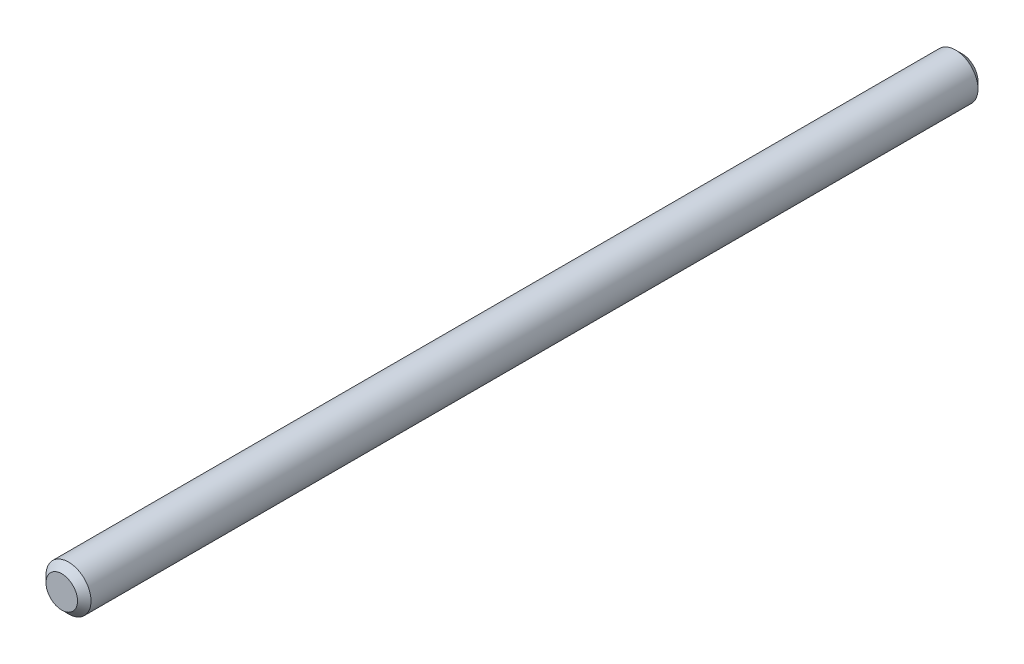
ISO-10303-21;
HEADER;
FILE_DESCRIPTION(('STEP AP214'),'2;1');
FILE_NAME('part.step','',(''),(''),'','','');
FILE_SCHEMA(('AUTOMOTIVE_DESIGN { 1 0 10303 214 1 1 1 1 }'));
ENDSEC;
DATA;
#1=APPLICATION_CONTEXT('core data for automotive mechanical design processes');
#2=APPLICATION_PROTOCOL_DEFINITION('international standard','automotive_design',2000,#1);
#3=PRODUCT_CONTEXT('',#1,'mechanical');
#4=PRODUCT('Part','Part','',(#3));
#5=PRODUCT_RELATED_PRODUCT_CATEGORY('part','',(#4));
#6=PRODUCT_DEFINITION_FORMATION('','',#4);
#7=PRODUCT_DEFINITION_CONTEXT('part definition',#1,'design');
#8=PRODUCT_DEFINITION('design','',#6,#7);
#9=PRODUCT_DEFINITION_SHAPE('','',#8);
#10=(LENGTH_UNIT() NAMED_UNIT(*) SI_UNIT(.MILLI.,.METRE.));
#11=(NAMED_UNIT(*) PLANE_ANGLE_UNIT() SI_UNIT($,.RADIAN.));
#12=(NAMED_UNIT(*) SI_UNIT($,.STERADIAN.) SOLID_ANGLE_UNIT());
#13=UNCERTAINTY_MEASURE_WITH_UNIT(LENGTH_MEASURE(1.E-05),#10,'distance_accuracy_value','');
#14=(GEOMETRIC_REPRESENTATION_CONTEXT(3) GLOBAL_UNCERTAINTY_ASSIGNED_CONTEXT((#13)) GLOBAL_UNIT_ASSIGNED_CONTEXT((#10,
#11,#12)) REPRESENTATION_CONTEXT('',''));
#15=CARTESIAN_POINT('',(0.,0.,0.));
#16=DIRECTION('',(0.,0.,1.));
#17=DIRECTION('',(1.,0.,0.));
#18=AXIS2_PLACEMENT_3D('',#15,#16,#17);
#19=CARTESIAN_POINT('',(0.,0.,40.));
#20=DIRECTION('',(0.,0.,-1.));
#21=DIRECTION('',(-1.,0.,0.));
#22=AXIS2_PLACEMENT_3D('',#19,#20,#21);
#23=CYLINDRICAL_SURFACE('',#22,1.);
#24=CARTESIAN_POINT('',(0.,0.,39.7));
#25=DIRECTION('',(0.,0.,1.));
#26=DIRECTION('',(1.,0.,0.));
#27=AXIS2_PLACEMENT_3D('',#24,#25,#26);
#28=CIRCLE('',#27,1.);
#29=CARTESIAN_POINT('',(1.,0.,39.7));
#30=VERTEX_POINT('',#29);
#31=EDGE_CURVE('E31',#30,#30,#28,.F.);
#32=ORIENTED_EDGE('',*,*,#31,.T.);
#33=EDGE_LOOP('',(#32));
#34=FACE_BOUND('',#33,.T.);
#35=CARTESIAN_POINT('',(0.,0.,0.300000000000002));
#36=DIRECTION('',(0.,0.,1.));
#37=DIRECTION('',(1.,0.,0.));
#38=AXIS2_PLACEMENT_3D('',#35,#36,#37);
#39=CIRCLE('',#38,1.);
#40=CARTESIAN_POINT('',(1.,0.,0.300000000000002));
#41=VERTEX_POINT('',#40);
#42=EDGE_CURVE('E35',#41,#41,#39,.T.);
#43=ORIENTED_EDGE('',*,*,#42,.T.);
#44=EDGE_LOOP('',(#43));
#45=FACE_BOUND('',#44,.T.);
#46=ADVANCED_FACE('F25',(#34,#45),#23,.T.);
#47=CARTESIAN_POINT('',(0.,0.,40.));
#48=DIRECTION('',(0.,0.,1.));
#49=DIRECTION('',(1.,0.,0.));
#50=AXIS2_PLACEMENT_3D('',#47,#48,#49);
#51=PLANE('',#50);
#52=CARTESIAN_POINT('',(0.,0.,40.));
#53=DIRECTION('',(0.,0.,1.));
#54=DIRECTION('',(1.,0.,0.));
#55=AXIS2_PLACEMENT_3D('',#52,#53,#54);
#56=CIRCLE('',#55,0.699999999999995);
#57=CARTESIAN_POINT('',(0.699999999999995,0.,40.));
#58=VERTEX_POINT('',#57);
#59=EDGE_CURVE('E39',#58,#58,#56,.T.);
#60=ORIENTED_EDGE('',*,*,#59,.T.);
#61=EDGE_LOOP('',(#60));
#62=FACE_BOUND('',#61,.T.);
#63=ADVANCED_FACE('F45',(#62),#51,.T.);
#64=CARTESIAN_POINT('',(0.,0.,0.));
#65=DIRECTION('',(0.,0.,1.));
#66=DIRECTION('',(1.,0.,0.));
#67=AXIS2_PLACEMENT_3D('',#64,#65,#66);
#68=PLANE('',#67);
#69=CARTESIAN_POINT('',(0.,0.,0.));
#70=DIRECTION('',(0.,0.,1.));
#71=DIRECTION('',(1.,0.,0.));
#72=AXIS2_PLACEMENT_3D('',#69,#70,#71);
#73=CIRCLE('',#72,0.699999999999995);
#74=CARTESIAN_POINT('',(0.699999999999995,0.,0.));
#75=VERTEX_POINT('',#74);
#76=EDGE_CURVE('E10',#75,#75,#73,.F.);
#77=ORIENTED_EDGE('',*,*,#76,.T.);
#78=EDGE_LOOP('',(#77));
#79=FACE_BOUND('',#78,.T.);
#80=ADVANCED_FACE('F50',(#79),#68,.F.);
#81=CARTESIAN_POINT('',(0.,0.,40.));
#82=DIRECTION('',(0.,0.,-1.));
#83=DIRECTION('',(-1.,0.,0.));
#84=AXIS2_PLACEMENT_3D('',#81,#82,#83);
#85=CONICAL_SURFACE('',#84,0.699999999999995,0.785398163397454);
#86=ORIENTED_EDGE('',*,*,#31,.F.);
#87=EDGE_LOOP('',(#86));
#88=FACE_BOUND('',#87,.T.);
#89=ORIENTED_EDGE('',*,*,#59,.F.);
#90=EDGE_LOOP('',(#89));
#91=FACE_BOUND('',#90,.T.);
#92=ADVANCED_FACE('F47',(#88,#91),#85,.T.);
#93=CARTESIAN_POINT('',(0.,0.,0.300000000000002));
#94=DIRECTION('',(0.,0.,1.));
#95=DIRECTION('',(1.,0.,0.));
#96=AXIS2_PLACEMENT_3D('',#93,#94,#95);
#97=CONICAL_SURFACE('',#96,1.,0.785398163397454);
#98=ORIENTED_EDGE('',*,*,#76,.F.);
#99=EDGE_LOOP('',(#98));
#100=FACE_BOUND('',#99,.T.);
#101=ORIENTED_EDGE('',*,*,#42,.F.);
#102=EDGE_LOOP('',(#101));
#103=FACE_BOUND('',#102,.T.);
#104=ADVANCED_FACE('F49',(#100,#103),#97,.T.);
#105=CLOSED_SHELL('',(#46,#63,#80,#92,#104));
#106=MANIFOLD_SOLID_BREP('B2',#105);
#107=ADVANCED_BREP_SHAPE_REPRESENTATION('',(#18,#106),#14);
#108=SHAPE_DEFINITION_REPRESENTATION(#9,#107);
ENDSEC;
END-ISO-10303-21;
